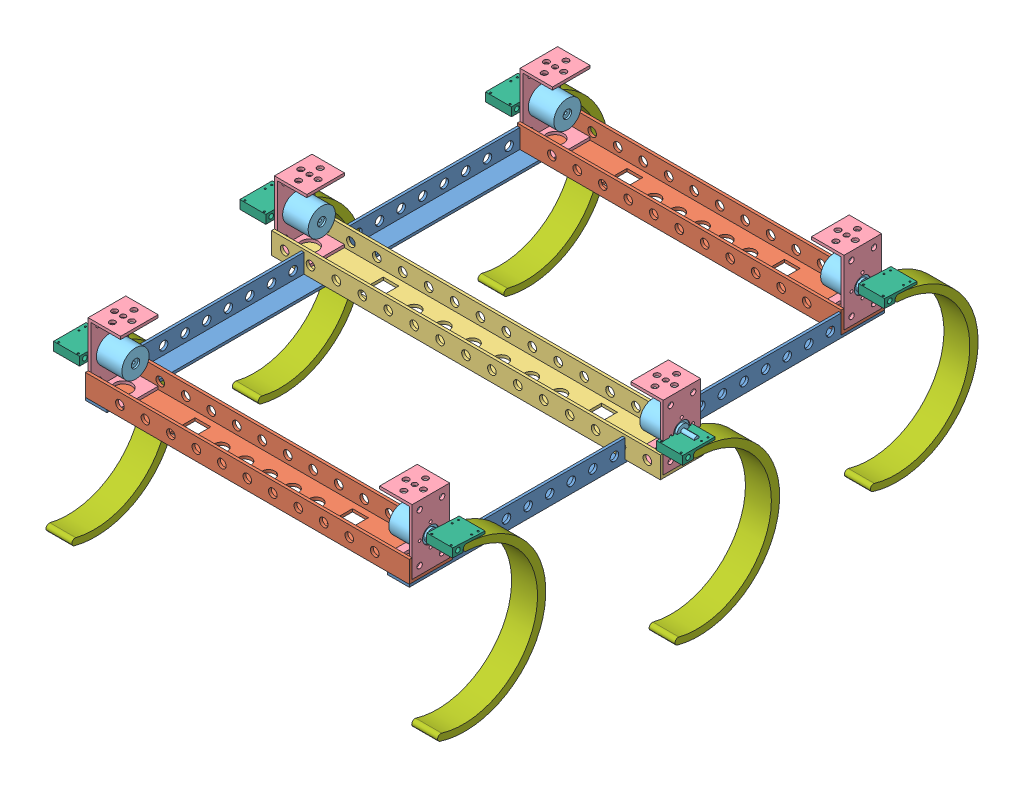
SolidWorks assembly assembly.SLDASM, configuration Default (file format 7000). Lengths in mm.
Overall size (521.26 251.57 679.24).
36 component instances, 7 part files, 28 mates.
Components (placement in the parent):
- Base Frame-1: Base Frame.SLDASM [Default] at (-115.2975 -138.8189 23.4683) size (457.2 82.55 558.8)
  - Runners(inches)-1: Runners(inches).SLDPRT [Default] at (164.3139 303.861 189.2738) size (25.4 25.4 558.8)
  - Cross Members(Front+Back)-1: Cross Members(Front+Back).SLDPRT [Default] at (502.1432 300.3197 720.2046) x (0 0 1) z (-1 0 0) size (50.8 25.4 381)
  - Cross Members(Front+Back)-2: Cross Members(Front+Back).SLDPRT [Default] at (121.1432 300.3197 217.143) x (0 0 -1) z (1 0 0) size (50.8 25.4 381)
  - Runners(inches)-2: Runners(inches).SLDPRT [Default] at (458.9725 303.861 748.0738) x (-1 0 0) z (0 0 -1) size (25.4 25.4 558.8)
  - Cross Members(Middle)-1: Cross Members(Middle).SLDPRT [Default] at (543.4286 299.6197 466.2046) x (0 0 1) z (-1 0 0) size (50.8 25.4 457.2)
  - mounting mounting-1: mounting mounting.SLDPRT [Default] at (480.68 323.6449 744.7718) x (0 -1 0) z (0 0 -1) size (76.2 38.1 44.2)
  - mounting mounting-2: mounting mounting.SLDPRT [Default] at (521.9653 323.6449 490.7718) x (0 -1 0) z (0 0 -1) size (76.2 38.1 44.2)
  - mounting mounting-3: mounting mounting.SLDPRT [Default] at (142.6064 323.6449 700.5758) x (0 -1 0) z (0 0 1) size (76.2 38.1 44.2)
  - mounting mounting-4: mounting mounting.SLDPRT [Default] at (107.6918 323.6449 446.5758) x (0 -1 0) z (0 0 1) size (76.2 38.1 44.2)
  - mounting mounting-5: mounting mounting.SLDPRT [Default] at (142.6064 323.6449 192.5758) x (0 -1 0) z (0 0 1) size (76.2 38.1 44.2)
  - mounting mounting-6: mounting mounting.SLDPRT [Default] at (480.68 323.6449 236.7718) x (0 -1 0) z (0 0 -1) size (76.2 38.1 44.2)
- gearhead (166163)-7: gearhead (166163).SLDPRT [Default] at (353.5437 180.917 744.5984) x (0 0 -1) z (1 0 0) size (32 32 51)
- gearhead (166163)-8: gearhead (166163).SLDPRT [Default] at (394.8291 180.917 490.5984) x (0 0 -1) z (1 0 0) size (32 32 51)
- gearhead (166163)-9: gearhead (166163).SLDPRT [Default] at (353.5437 180.917 236.5984) x (0 0 -1) z (1 0 0) size (32 32 51)
- gearhead (166163)-10: gearhead (166163).SLDPRT [Default] at (4.2331 180.917 493.6858) x (0 0 1) z (-1 0 0) size (32 32 51)
- gearhead (166163)-11: gearhead (166163).SLDPRT [Default] at (39.1477 180.917 239.6858) x (0 0 1) z (-1 0 0) size (32 32 51)
- gearhead (166163)-12: gearhead (166163).SLDPRT [Default] at (39.1477 180.917 747.6858) x (0 0 1) z (-1 0 0) size (32 32 51)
- Leg attachment+Leg-1: Leg attachment+Leg.SLDASM [Default] at (374.468 170.7606 710.4084) x (0 -0.047079 -0.998891) z (1 0 0) size (152.95 209.79 30.48)
  - Leg attachment-2: Leg attachment.SLDPRT [Default] at (-15.6447 8.4512 13.9257) size (38.1 10.16 30.48)
  - Leg-2: Leg.SLDPRT [Default] at (-33.3206 -82.7333 44.4057) x (-0.981655 0.190667 0) z (0 0 -1) size (118.81 190.5 30.48)
- Leg attachment+Leg-2: Leg attachment+Leg.SLDASM [Default] at (409.816 166.93 474.6481) x (0 0 -1) z (1 0 0) size (152.95 209.79 30.48)
  - Leg attachment-2: Leg attachment.SLDPRT [Default] at (-15.6447 8.4512 13.9257) size (38.1 10.16 30.48)
  - Leg-2: Leg.SLDPRT [Default] at (-33.3206 -82.7333 44.4057) x (-0.981655 0.190667 0) z (0 0 -1) size (118.81 190.5 30.48)
- Leg attachment+Leg-3: Leg attachment+Leg.SLDASM [Default] at (374.468 170.9452 202.3568) x (0 -0.041957 -0.999119) z (1 0 0) size (152.95 209.79 30.48)
  - Leg attachment-2: Leg attachment.SLDPRT [Default] at (-15.6447 8.4512 13.9257) size (38.1 10.16 30.48)
  - Leg-2: Leg.SLDPRT [Default] at (-33.3206 -82.7333 44.4057) x (-0.981655 0.190667 0) z (0 0 -1) size (118.81 190.5 30.48)
- Leg attachment+Leg-4: Leg attachment+Leg.SLDASM [Default] at (-46.0454 166.93 728.1542) x (0 0 -1) z (1 0 0) size (152.95 209.79 30.48)
  - Leg attachment-2: Leg attachment.SLDPRT [Default] at (-15.6447 8.4512 13.9257) size (38.1 10.16 30.48)
  - Leg-2: Leg.SLDPRT [Default] at (-33.3206 -82.7333 44.4057) x (-0.981655 0.190667 0) z (0 0 -1) size (118.81 190.5 30.48)
- Leg attachment+Leg-5: Leg attachment+Leg.SLDASM [Default] at (-80.96 166.93 474.1542) x (0 0 -1) z (1 0 0) size (152.95 209.79 30.48)
  - Leg attachment-2: Leg attachment.SLDPRT [Default] at (-15.6447 8.4512 13.9257) size (38.1 10.16 30.48)
  - Leg-2: Leg.SLDPRT [Default] at (-33.3206 -82.7333 44.4057) x (-0.981655 0.190667 0) z (0 0 -1) size (118.81 190.5 30.48)
- Leg attachment+Leg-6: Leg attachment+Leg.SLDASM [Default] at (-46.0454 166.93 220.1542) x (0 0 -1) z (1 0 0) size (152.95 209.79 30.48)
  - Leg attachment-2: Leg attachment.SLDPRT [Default] at (-15.6447 8.4512 13.9257) size (38.1 10.16 30.48)
  - Leg-2: Leg.SLDPRT [Default] at (-33.3206 -82.7333 44.4057) x (-0.981655 0.190667 0) z (0 0 -1) size (118.81 190.5 30.48)
Mates (geometry in assembly coordinates):
- Coincident1: coincident anti-aligned: plane of Base Frame-1/mounting mounting-1 through (383.5437 218.89 724.0441) normal (-1 0 0); plane of gearhead (166163)-7 through (383.5437 180.917 746.389) normal (1 0 0)
- Concentric1: concentric anti-aligned: cylinder of Base Frame-1/mounting mounting-1 through (326.3937 180.917 746.389) axis (1 0 0) radius 9.65; cylinder of gearhead (166163)-7 through (385.7937 180.917 746.389) axis (-1 0 0) radius 9.5
- Coincident2: coincident anti-aligned: plane of Base Frame-1/mounting mounting-2 through (424.8291 218.89 470.0441) normal (-1 0 0); plane of gearhead (166163)-8 through (424.8291 180.917 492.389) normal (1 0 0)
- Concentric2: concentric anti-aligned: cylinder of Base Frame-1/mounting mounting-2 through (367.6791 180.917 492.389) axis (1 0 0) radius 9.65; cylinder of gearhead (166163)-8 through (427.0791 180.917 492.389) axis (-1 0 0) radius 9.5
- Coincident3: coincident anti-aligned: plane of Base Frame-1/mounting mounting-6 through (383.5437 218.89 216.0441) normal (-1 0 0); plane of gearhead (166163)-9 through (383.5437 180.917 238.389) normal (1 0 0)
- Concentric3: concentric anti-aligned: cylinder of Base Frame-1/mounting mounting-6 through (326.3937 180.917 238.389) axis (1 0 0) radius 9.65; cylinder of gearhead (166163)-9 through (385.7937 180.917 238.389) axis (-1 0 0) radius 9.5
- Coincident4: coincident anti-aligned: plane of Base Frame-1/mounting mounting-5 through (9.1477 218.89 260.2401) normal (1 0 0); plane of gearhead (166163)-11 through (9.1477 180.917 237.8952) normal (-1 0 0)
- Concentric4: concentric anti-aligned: cylinder of Base Frame-1/mounting mounting-5 through (66.2977 180.917 237.8952) axis (-1 0 0) radius 9.65; cylinder of gearhead (166163)-11 through (6.8977 180.917 237.8952) axis (1 0 0) radius 9.5
- Coincident5: coincident anti-aligned: plane of Base Frame-1/mounting mounting-4 through (-25.7669 218.89 514.2401) normal (1 0 0); plane of gearhead (166163)-10 through (-25.7669 180.917 491.8952) normal (-1 0 0)
- Concentric5: concentric anti-aligned: cylinder of Base Frame-1/mounting mounting-4 through (31.3831 180.917 491.8952) axis (-1 0 0) radius 9.65; cylinder of gearhead (166163)-10 through (-28.0169 180.917 491.8952) axis (1 0 0) radius 9.5
- Coincident6: coincident anti-aligned: plane of Base Frame-1/mounting mounting-3 through (9.1477 218.89 768.2401) normal (1 0 0); plane of gearhead (166163)-12 through (9.1477 180.917 745.8952) normal (-1 0 0)
- Concentric6: concentric anti-aligned: cylinder of Base Frame-1/mounting mounting-3 through (66.2977 180.917 745.8952) axis (-1 0 0) radius 9.65; cylinder of gearhead (166163)-12 through (6.8977 180.917 745.8952) axis (1 0 0) radius 9.5
- Concentric19: concentric anti-aligned: cylinder of gearhead (166163)-7 through (404.5437 180.917 746.389) axis (-1 0 0) radius 2.75; cylinder of ? through (377.4717 180.917 746.389) axis (1 0 0) radius 2.75
- Coincident19: coincident anti-aligned: plane of gearhead (166163)-7 through (388.3937 180.917 746.389) normal (1 0 0); plane of ? through (388.3937 179.3443 736.229) normal (-1 0 0)
- Concentric20: concentric anti-aligned: cylinder of gearhead (166163)-8 through (445.8291 180.917 492.389) axis (-1 0 0) radius 2.75; cylinder of ? through (418.7571 180.917 492.389) axis (1 0 0) radius 2.75
- Coincident20: coincident anti-aligned: plane of gearhead (166163)-8 through (429.6791 180.917 492.389) normal (1 0 0); plane of ? through (429.6791 179.3443 482.229) normal (-1 0 0)
- Concentric21: concentric anti-aligned: cylinder of gearhead (166163)-9 through (404.5437 180.917 238.389) axis (-1 0 0) radius 2.75; cylinder of ? through (377.4717 180.917 238.389) axis (1 0 0) radius 2.75
- Coincident21: coincident anti-aligned: plane of gearhead (166163)-9 through (388.3937 180.917 238.389) normal (1 0 0); plane of ? through (388.3937 179.3443 228.229) normal (-1 0 0)
- Concentric22: concentric aligned: cylinder of gearhead (166163)-11 through (-11.8523 180.917 237.8952) axis (1 0 0) radius 2.75; cylinder of ? through (-37.1043 180.917 237.8952) axis (1 0 0) radius 2.75
- Coincident22: coincident anti-aligned: plane of gearhead (166163)-11 through (4.2977 180.917 237.8952) normal (-1 0 0); plane of ? through (4.2977 179.3443 227.7352) normal (1 0 0)
- Concentric23: concentric aligned: cylinder of gearhead (166163)-10 through (-46.7669 180.917 491.8952) axis (1 0 0) radius 2.75; cylinder of ? through (-72.0189 180.917 491.8952) axis (1 0 0) radius 2.75
- Coincident23: coincident anti-aligned: plane of gearhead (166163)-10 through (-30.6169 180.917 491.8952) normal (-1 0 0); plane of ? through (-30.6169 179.3443 481.7352) normal (1 0 0)
- Concentric24: concentric aligned: cylinder of gearhead (166163)-12 through (-11.8523 180.917 745.8952) axis (1 0 0) radius 2.75; cylinder of ? through (-37.1043 180.917 745.8952) axis (1 0 0) radius 2.75
- Coincident24: coincident anti-aligned: plane of gearhead (166163)-12 through (4.2977 180.917 745.8952) normal (-1 0 0); plane of ? through (4.2977 179.3443 735.7352) normal (1 0 0)
- Concentric25: concentric anti-aligned: cylinder of gearhead (166163)-7 through (404.5437 180.917 746.389) axis (-1 0 0) radius 2.75; cylinder of Leg attachment+Leg-1/Leg attachment-2 through (377.4717 180.917 746.389) axis (1 0 0) radius 2.75
- Coincident25: coincident anti-aligned: plane of gearhead (166163)-7 through (388.3937 180.917 746.389) normal (1 0 0); plane of Leg attachment+Leg-1/Leg attachment-2 through (388.3937 178.8677 736.3143) normal (-1 0 0)
- Concentric26: concentric anti-aligned: cylinder of gearhead (166163)-9 through (404.5437 180.917 238.389) axis (-1 0 0) radius 2.75; cylinder of Leg attachment+Leg-3/Leg attachment-2 through (377.4717 180.917 238.389) axis (1 0 0) radius 2.75
- Coincident26: coincident anti-aligned: plane of gearhead (166163)-9 through (388.3937 180.917 238.389) normal (1 0 0); plane of Leg attachment+Leg-3/Leg attachment-2 through (388.3937 178.9194 228.304) normal (-1 0 0)
